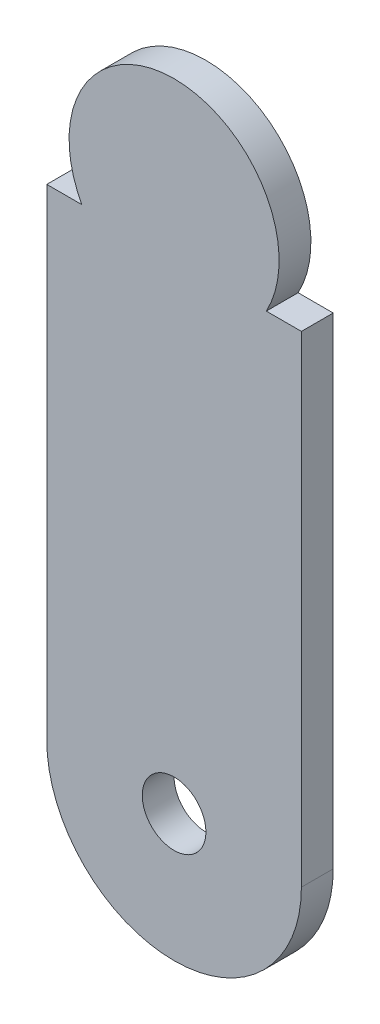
ISO-10303-21;
HEADER;
FILE_DESCRIPTION(('STEP AP214'),'2;1');
FILE_NAME('part.step','',(''),(''),'','','');
FILE_SCHEMA(('AUTOMOTIVE_DESIGN { 1 0 10303 214 1 1 1 1 }'));
ENDSEC;
DATA;
#1=APPLICATION_CONTEXT('core data for automotive mechanical design processes');
#2=APPLICATION_PROTOCOL_DEFINITION('international standard','automotive_design',2000,#1);
#3=PRODUCT_CONTEXT('',#1,'mechanical');
#4=PRODUCT('Part','Part','',(#3));
#5=PRODUCT_RELATED_PRODUCT_CATEGORY('part','',(#4));
#6=PRODUCT_DEFINITION_FORMATION('','',#4);
#7=PRODUCT_DEFINITION_CONTEXT('part definition',#1,'design');
#8=PRODUCT_DEFINITION('design','',#6,#7);
#9=PRODUCT_DEFINITION_SHAPE('','',#8);
#10=(LENGTH_UNIT() NAMED_UNIT(*) SI_UNIT(.MILLI.,.METRE.));
#11=(NAMED_UNIT(*) PLANE_ANGLE_UNIT() SI_UNIT($,.RADIAN.));
#12=(NAMED_UNIT(*) SI_UNIT($,.STERADIAN.) SOLID_ANGLE_UNIT());
#13=UNCERTAINTY_MEASURE_WITH_UNIT(LENGTH_MEASURE(1.E-05),#10,'distance_accuracy_value','');
#14=(GEOMETRIC_REPRESENTATION_CONTEXT(3) GLOBAL_UNCERTAINTY_ASSIGNED_CONTEXT((#13)) GLOBAL_UNIT_ASSIGNED_CONTEXT((#10,
#11,#12)) REPRESENTATION_CONTEXT('',''));
#15=CARTESIAN_POINT('',(0.,0.,0.));
#16=DIRECTION('',(0.,0.,1.));
#17=DIRECTION('',(1.,0.,0.));
#18=AXIS2_PLACEMENT_3D('',#15,#16,#17);
#19=CARTESIAN_POINT('',(0.,21.27580803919,3.175));
#20=DIRECTION('',(0.,0.,1.));
#21=DIRECTION('',(1.,0.,0.));
#22=AXIS2_PLACEMENT_3D('',#19,#20,#21);
#23=PLANE('',#22);
#24=CARTESIAN_POINT('',(0.,21.27580803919,3.175));
#25=DIRECTION('',(0.,0.,1.));
#26=DIRECTION('',(1.,0.,0.));
#27=AXIS2_PLACEMENT_3D('',#24,#25,#26);
#28=CIRCLE('',#27,10.47419196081);
#29=CARTESIAN_POINT('',(9.19847111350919,16.2661347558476,3.175));
#30=VERTEX_POINT('',#29);
#31=CARTESIAN_POINT('',(-9.1984711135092,16.2661347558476,3.175));
#32=VERTEX_POINT('',#31);
#33=EDGE_CURVE('E128',#30,#32,#28,.T.);
#34=ORIENTED_EDGE('',*,*,#33,.T.);
#35=DIRECTION('',(-1.,0.,0.));
#36=VECTOR('',#35,1.);
#37=CARTESIAN_POINT('',(-12.7,16.2661347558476,3.175));
#38=LINE('',#37,#36);
#39=CARTESIAN_POINT('',(-12.7,16.2661347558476,3.175));
#40=VERTEX_POINT('',#39);
#41=EDGE_CURVE('E86',#32,#40,#38,.T.);
#42=ORIENTED_EDGE('',*,*,#41,.T.);
#43=DIRECTION('',(0.,-1.,0.));
#44=VECTOR('',#43,1.);
#45=CARTESIAN_POINT('',(-12.7,-31.75,3.175));
#46=LINE('',#45,#44);
#47=CARTESIAN_POINT('',(-12.7,-31.75,3.175));
#48=VERTEX_POINT('',#47);
#49=EDGE_CURVE('E99',#40,#48,#46,.T.);
#50=ORIENTED_EDGE('',*,*,#49,.T.);
#51=CARTESIAN_POINT('',(0.,-31.75,3.175));
#52=DIRECTION('',(0.,0.,1.));
#53=DIRECTION('',(1.,0.,0.));
#54=AXIS2_PLACEMENT_3D('',#51,#52,#53);
#55=CIRCLE('',#54,12.7);
#56=CARTESIAN_POINT('',(12.7,-31.75,3.175));
#57=VERTEX_POINT('',#56);
#58=EDGE_CURVE('E93',#48,#57,#55,.T.);
#59=ORIENTED_EDGE('',*,*,#58,.T.);
#60=DIRECTION('',(0.,1.,0.));
#61=VECTOR('',#60,1.);
#62=CARTESIAN_POINT('',(12.7,-31.75,3.175));
#63=LINE('',#62,#61);
#64=CARTESIAN_POINT('',(12.7,16.2661347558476,3.175));
#65=VERTEX_POINT('',#64);
#66=EDGE_CURVE('E97',#57,#65,#63,.T.);
#67=ORIENTED_EDGE('',*,*,#66,.T.);
#68=DIRECTION('',(-1.,0.,0.));
#69=VECTOR('',#68,1.);
#70=CARTESIAN_POINT('',(9.19847111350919,16.2661347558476,3.175));
#71=LINE('',#70,#69);
#72=EDGE_CURVE('E49',#65,#30,#71,.T.);
#73=ORIENTED_EDGE('',*,*,#72,.T.);
#74=EDGE_LOOP('',(#34,#42,#50,#59,#67,#73));
#75=FACE_BOUND('',#74,.T.);
#76=CARTESIAN_POINT('',(0.,-31.75,3.175));
#77=DIRECTION('',(0.,0.,1.));
#78=DIRECTION('',(1.,0.,0.));
#79=AXIS2_PLACEMENT_3D('',#76,#77,#78);
#80=CIRCLE('',#79,3.175);
#81=CARTESIAN_POINT('',(3.175,-31.75,3.175));
#82=VERTEX_POINT('',#81);
#83=EDGE_CURVE('E121',#82,#82,#80,.T.);
#84=ORIENTED_EDGE('',*,*,#83,.F.);
#85=EDGE_LOOP('',(#84));
#86=FACE_BOUND('',#85,.T.);
#87=ADVANCED_FACE('F32',(#75,#86),#23,.T.);
#88=CARTESIAN_POINT('',(0.,21.27580803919,0.));
#89=DIRECTION('',(0.,0.,1.));
#90=DIRECTION('',(1.,0.,0.));
#91=AXIS2_PLACEMENT_3D('',#88,#89,#90);
#92=PLANE('',#91);
#93=CARTESIAN_POINT('',(0.,21.27580803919,0.));
#94=DIRECTION('',(0.,0.,1.));
#95=DIRECTION('',(1.,0.,0.));
#96=AXIS2_PLACEMENT_3D('',#93,#94,#95);
#97=CIRCLE('',#96,10.47419196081);
#98=CARTESIAN_POINT('',(9.19847111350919,16.2661347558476,0.));
#99=VERTEX_POINT('',#98);
#100=CARTESIAN_POINT('',(-9.1984711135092,16.2661347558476,0.));
#101=VERTEX_POINT('',#100);
#102=EDGE_CURVE('E117',#99,#101,#97,.T.);
#103=ORIENTED_EDGE('',*,*,#102,.F.);
#104=DIRECTION('',(-1.,0.,0.));
#105=VECTOR('',#104,1.);
#106=CARTESIAN_POINT('',(9.19847111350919,16.2661347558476,0.));
#107=LINE('',#106,#105);
#108=CARTESIAN_POINT('',(12.7,16.2661347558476,0.));
#109=VERTEX_POINT('',#108);
#110=EDGE_CURVE('E78',#109,#99,#107,.T.);
#111=ORIENTED_EDGE('',*,*,#110,.F.);
#112=DIRECTION('',(0.,1.,0.));
#113=VECTOR('',#112,1.);
#114=CARTESIAN_POINT('',(12.7,-31.75,0.));
#115=LINE('',#114,#113);
#116=CARTESIAN_POINT('',(12.7,-31.75,0.));
#117=VERTEX_POINT('',#116);
#118=EDGE_CURVE('E72',#117,#109,#115,.T.);
#119=ORIENTED_EDGE('',*,*,#118,.F.);
#120=CARTESIAN_POINT('',(0.,-31.75,0.));
#121=DIRECTION('',(0.,0.,1.));
#122=DIRECTION('',(1.,0.,0.));
#123=AXIS2_PLACEMENT_3D('',#120,#121,#122);
#124=CIRCLE('',#123,12.7);
#125=CARTESIAN_POINT('',(-12.7,-31.75,0.));
#126=VERTEX_POINT('',#125);
#127=EDGE_CURVE('E107',#126,#117,#124,.T.);
#128=ORIENTED_EDGE('',*,*,#127,.F.);
#129=DIRECTION('',(0.,-1.,0.));
#130=VECTOR('',#129,1.);
#131=CARTESIAN_POINT('',(-12.7,-31.75,0.));
#132=LINE('',#131,#130);
#133=CARTESIAN_POINT('',(-12.7,16.2661347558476,0.));
#134=VERTEX_POINT('',#133);
#135=EDGE_CURVE('E123',#134,#126,#132,.T.);
#136=ORIENTED_EDGE('',*,*,#135,.F.);
#137=DIRECTION('',(-1.,0.,0.));
#138=VECTOR('',#137,1.);
#139=CARTESIAN_POINT('',(-12.7,16.2661347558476,0.));
#140=LINE('',#139,#138);
#141=EDGE_CURVE('E120',#101,#134,#140,.T.);
#142=ORIENTED_EDGE('',*,*,#141,.F.);
#143=EDGE_LOOP('',(#103,#111,#119,#128,#136,#142));
#144=FACE_BOUND('',#143,.T.);
#145=CARTESIAN_POINT('',(0.,-31.75,0.));
#146=DIRECTION('',(0.,0.,1.));
#147=DIRECTION('',(1.,0.,0.));
#148=AXIS2_PLACEMENT_3D('',#145,#146,#147);
#149=CIRCLE('',#148,3.175);
#150=CARTESIAN_POINT('',(3.175,-31.75,0.));
#151=VERTEX_POINT('',#150);
#152=EDGE_CURVE('E221',#151,#151,#149,.T.);
#153=ORIENTED_EDGE('',*,*,#152,.T.);
#154=EDGE_LOOP('',(#153));
#155=FACE_BOUND('',#154,.T.);
#156=ADVANCED_FACE('F137',(#144,#155),#92,.F.);
#157=CARTESIAN_POINT('',(0.,21.27580803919,3.175));
#158=DIRECTION('',(0.,0.,-1.));
#159=DIRECTION('',(-1.,0.,0.));
#160=AXIS2_PLACEMENT_3D('',#157,#158,#159);
#161=CYLINDRICAL_SURFACE('',#160,10.47419196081);
#162=ORIENTED_EDGE('',*,*,#102,.T.);
#163=DIRECTION('',(0.,0.,-1.));
#164=VECTOR('',#163,1.);
#165=CARTESIAN_POINT('',(-9.1984711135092,16.2661347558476,3.175));
#166=LINE('',#165,#164);
#167=EDGE_CURVE('E11',#32,#101,#166,.T.);
#168=ORIENTED_EDGE('',*,*,#167,.F.);
#169=ORIENTED_EDGE('',*,*,#33,.F.);
#170=DIRECTION('',(0.,0.,-1.));
#171=VECTOR('',#170,1.);
#172=CARTESIAN_POINT('',(9.19847111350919,16.2661347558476,3.175));
#173=LINE('',#172,#171);
#174=EDGE_CURVE('E113',#30,#99,#173,.T.);
#175=ORIENTED_EDGE('',*,*,#174,.T.);
#176=EDGE_LOOP('',(#162,#168,#169,#175));
#177=FACE_BOUND('',#176,.T.);
#178=ADVANCED_FACE('F34',(#177),#161,.T.);
#179=CARTESIAN_POINT('',(-12.7,16.2661347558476,3.175));
#180=DIRECTION('',(0.,-1.,0.));
#181=DIRECTION('',(0.,0.,-1.));
#182=AXIS2_PLACEMENT_3D('',#179,#180,#181);
#183=PLANE('',#182);
#184=ORIENTED_EDGE('',*,*,#141,.T.);
#185=DIRECTION('',(0.,0.,-1.));
#186=VECTOR('',#185,1.);
#187=CARTESIAN_POINT('',(-12.7,16.2661347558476,3.175));
#188=LINE('',#187,#186);
#189=EDGE_CURVE('E41',#40,#134,#188,.T.);
#190=ORIENTED_EDGE('',*,*,#189,.F.);
#191=ORIENTED_EDGE('',*,*,#41,.F.);
#192=ORIENTED_EDGE('',*,*,#167,.T.);
#193=EDGE_LOOP('',(#184,#190,#191,#192));
#194=FACE_BOUND('',#193,.T.);
#195=ADVANCED_FACE('F162',(#194),#183,.F.);
#196=CARTESIAN_POINT('',(-12.7,-31.75,3.175));
#197=DIRECTION('',(1.,0.,0.));
#198=DIRECTION('',(0.,0.,-1.));
#199=AXIS2_PLACEMENT_3D('',#196,#197,#198);
#200=PLANE('',#199);
#201=ORIENTED_EDGE('',*,*,#135,.T.);
#202=DIRECTION('',(0.,0.,-1.));
#203=VECTOR('',#202,1.);
#204=CARTESIAN_POINT('',(-12.7,-31.75,3.175));
#205=LINE('',#204,#203);
#206=EDGE_CURVE('E108',#48,#126,#205,.T.);
#207=ORIENTED_EDGE('',*,*,#206,.F.);
#208=ORIENTED_EDGE('',*,*,#49,.F.);
#209=ORIENTED_EDGE('',*,*,#189,.T.);
#210=EDGE_LOOP('',(#201,#207,#208,#209));
#211=FACE_BOUND('',#210,.T.);
#212=ADVANCED_FACE('F134',(#211),#200,.F.);
#213=CARTESIAN_POINT('',(0.,-31.75,3.175));
#214=DIRECTION('',(0.,0.,-1.));
#215=DIRECTION('',(-1.,0.,0.));
#216=AXIS2_PLACEMENT_3D('',#213,#214,#215);
#217=CYLINDRICAL_SURFACE('',#216,12.7);
#218=ORIENTED_EDGE('',*,*,#127,.T.);
#219=DIRECTION('',(0.,0.,-1.));
#220=VECTOR('',#219,1.);
#221=CARTESIAN_POINT('',(12.7,-31.75,3.175));
#222=LINE('',#221,#220);
#223=EDGE_CURVE('E104',#57,#117,#222,.T.);
#224=ORIENTED_EDGE('',*,*,#223,.F.);
#225=ORIENTED_EDGE('',*,*,#58,.F.);
#226=ORIENTED_EDGE('',*,*,#206,.T.);
#227=EDGE_LOOP('',(#218,#224,#225,#226));
#228=FACE_BOUND('',#227,.T.);
#229=ADVANCED_FACE('F105',(#228),#217,.T.);
#230=CARTESIAN_POINT('',(12.7,-31.75,3.175));
#231=DIRECTION('',(-1.,0.,0.));
#232=DIRECTION('',(0.,-1.,0.));
#233=AXIS2_PLACEMENT_3D('',#230,#231,#232);
#234=PLANE('',#233);
#235=ORIENTED_EDGE('',*,*,#118,.T.);
#236=DIRECTION('',(0.,0.,-1.));
#237=VECTOR('',#236,1.);
#238=CARTESIAN_POINT('',(12.7,16.2661347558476,3.175));
#239=LINE('',#238,#237);
#240=EDGE_CURVE('E109',#65,#109,#239,.T.);
#241=ORIENTED_EDGE('',*,*,#240,.F.);
#242=ORIENTED_EDGE('',*,*,#66,.F.);
#243=ORIENTED_EDGE('',*,*,#223,.T.);
#244=EDGE_LOOP('',(#235,#241,#242,#243));
#245=FACE_BOUND('',#244,.T.);
#246=ADVANCED_FACE('F111',(#245),#234,.F.);
#247=CARTESIAN_POINT('',(9.19847111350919,16.2661347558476,3.175));
#248=DIRECTION('',(0.,-1.,0.));
#249=DIRECTION('',(0.,0.,-1.));
#250=AXIS2_PLACEMENT_3D('',#247,#248,#249);
#251=PLANE('',#250);
#252=ORIENTED_EDGE('',*,*,#110,.T.);
#253=ORIENTED_EDGE('',*,*,#174,.F.);
#254=ORIENTED_EDGE('',*,*,#72,.F.);
#255=ORIENTED_EDGE('',*,*,#240,.T.);
#256=EDGE_LOOP('',(#252,#253,#254,#255));
#257=FACE_BOUND('',#256,.T.);
#258=ADVANCED_FACE('F142',(#257),#251,.F.);
#259=CARTESIAN_POINT('',(0.,-31.75,3.175));
#260=DIRECTION('',(0.,0.,-1.));
#261=DIRECTION('',(-1.,0.,0.));
#262=AXIS2_PLACEMENT_3D('',#259,#260,#261);
#263=CYLINDRICAL_SURFACE('',#262,3.175);
#264=ORIENTED_EDGE('',*,*,#83,.T.);
#265=EDGE_LOOP('',(#264));
#266=FACE_BOUND('',#265,.T.);
#267=ORIENTED_EDGE('',*,*,#152,.F.);
#268=EDGE_LOOP('',(#267));
#269=FACE_BOUND('',#268,.T.);
#270=ADVANCED_FACE('F144',(#266,#269),#263,.F.);
#271=CLOSED_SHELL('',(#87,#156,#178,#195,#212,#229,#246,#258,#270));
#272=MANIFOLD_SOLID_BREP('B2',#271);
#273=ADVANCED_BREP_SHAPE_REPRESENTATION('',(#18,#272),#14);
#274=SHAPE_DEFINITION_REPRESENTATION(#9,#273);
ENDSEC;
END-ISO-10303-21;
